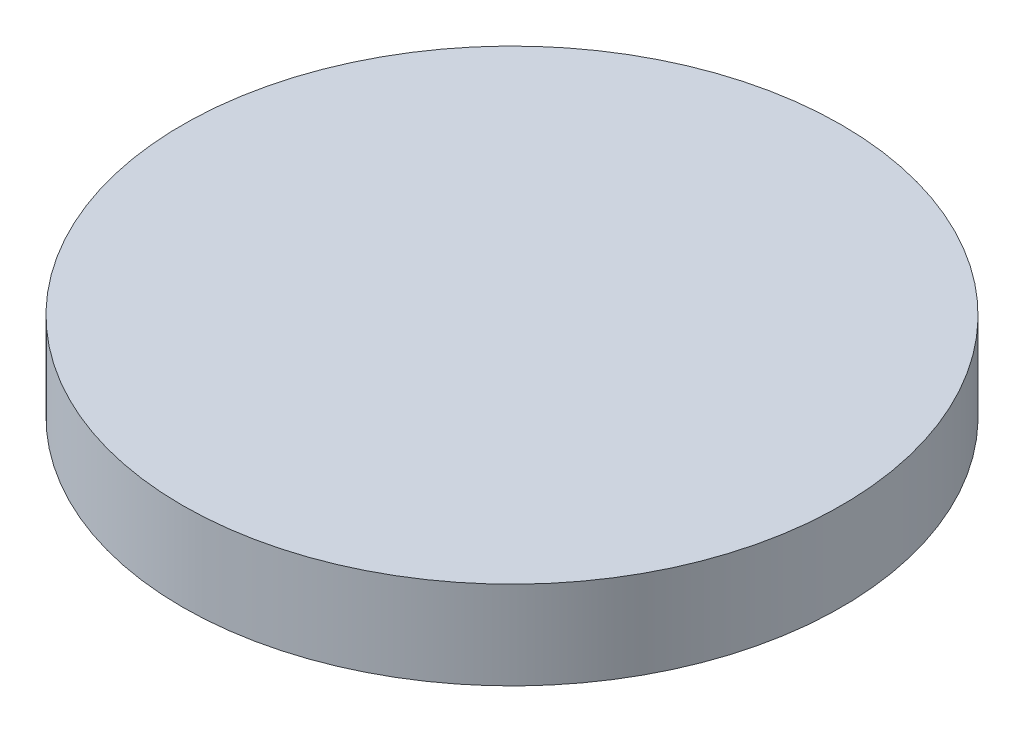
from build123d import *

# Parameters (mm, degrees)
SKETCH1_R           = 9.5
BOSS_EXTRUDE1_DEPTH = 1.27


with BuildPart() as part:
    # Sketch1 → Boss-Extrude1 (new, symmetric)
    with BuildSketch(Plane(origin=(0, 0, 0), x_dir=(1, 0, 0), z_dir=(0, 1, 0))):
        with Locations(Location((0, 0, 0), (0, 0, 270))):
            Circle(SKETCH1_R)
    extrude(amount=BOSS_EXTRUDE1_DEPTH, both=True)


solid = part.part
